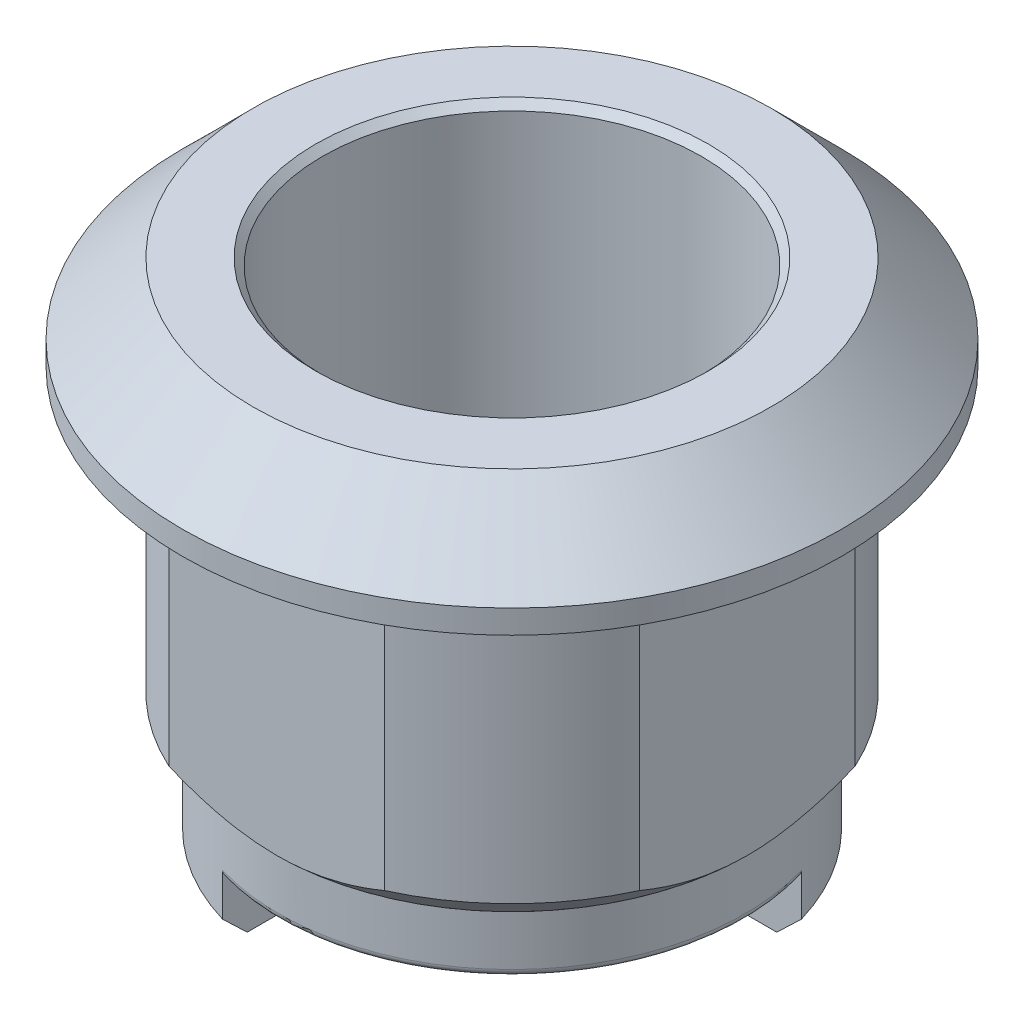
ISO-10303-21;
HEADER;
FILE_DESCRIPTION(('STEP AP214'),'2;1');
FILE_NAME('part.step','',(''),(''),'','','');
FILE_SCHEMA(('AUTOMOTIVE_DESIGN { 1 0 10303 214 1 1 1 1 }'));
ENDSEC;
DATA;
#1=APPLICATION_CONTEXT('core data for automotive mechanical design processes');
#2=APPLICATION_PROTOCOL_DEFINITION('international standard','automotive_design',2000,#1);
#3=PRODUCT_CONTEXT('',#1,'mechanical');
#4=PRODUCT('Part','Part','',(#3));
#5=PRODUCT_RELATED_PRODUCT_CATEGORY('part','',(#4));
#6=PRODUCT_DEFINITION_FORMATION('','',#4);
#7=PRODUCT_DEFINITION_CONTEXT('part definition',#1,'design');
#8=PRODUCT_DEFINITION('design','',#6,#7);
#9=PRODUCT_DEFINITION_SHAPE('','',#8);
#10=(LENGTH_UNIT() NAMED_UNIT(*) SI_UNIT(.MILLI.,.METRE.));
#11=(NAMED_UNIT(*) PLANE_ANGLE_UNIT() SI_UNIT($,.RADIAN.));
#12=(NAMED_UNIT(*) SI_UNIT($,.STERADIAN.) SOLID_ANGLE_UNIT());
#13=UNCERTAINTY_MEASURE_WITH_UNIT(LENGTH_MEASURE(1.E-05),#10,'distance_accuracy_value','');
#14=(GEOMETRIC_REPRESENTATION_CONTEXT(3) GLOBAL_UNCERTAINTY_ASSIGNED_CONTEXT((#13)) GLOBAL_UNIT_ASSIGNED_CONTEXT((#10,
#11,#12)) REPRESENTATION_CONTEXT('',''));
#15=CARTESIAN_POINT('',(0.,0.,0.));
#16=DIRECTION('',(0.,0.,1.));
#17=DIRECTION('',(1.,0.,0.));
#18=AXIS2_PLACEMENT_3D('',#15,#16,#17);
#19=CARTESIAN_POINT('',(0.,-11.9999999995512,0.));
#20=DIRECTION('',(0.,1.,0.));
#21=DIRECTION('',(0.,0.,1.));
#22=AXIS2_PLACEMENT_3D('',#19,#20,#21);
#23=CONICAL_SURFACE('',#22,10.9999999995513,0.785398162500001);
#24=CARTESIAN_POINT('',(0.,-13.0000000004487,0.));
#25=DIRECTION('',(0.,1.,0.));
#26=DIRECTION('',(0.,0.,1.));
#27=AXIS2_PLACEMENT_3D('',#24,#25,#26);
#28=CIRCLE('',#27,10.0000000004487);
#29=CARTESIAN_POINT('',(-2.71595792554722E-11,-13.0000000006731,-10.0000000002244));
#30=VERTEX_POINT('',#29);
#31=CARTESIAN_POINT('',(10.0000000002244,-13.0000000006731,2.71609482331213E-11));
#32=VERTEX_POINT('',#31);
#33=EDGE_CURVE('P0_E409',#30,#32,#28,.F.);
#34=ORIENTED_EDGE('',*,*,#33,.F.);
#35=CARTESIAN_POINT('',(-2.71598870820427E-11,-13.0000000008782,-9.99999999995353));
#36=CARTESIAN_POINT('',(0.153419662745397,-13.0000177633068,-9.99999999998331));
#37=CARTESIAN_POINT('',(0.306833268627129,-12.996469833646,-9.99999999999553));
#38=CARTESIAN_POINT('',(0.613315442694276,-12.9823745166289,-10.0000000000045));
#39=CARTESIAN_POINT('',(0.766384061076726,-12.9718282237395,-10.0000000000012));
#40=CARTESIAN_POINT('',(1.07166096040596,-12.9438891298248,-9.9999999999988));
#41=CARTESIAN_POINT('',(1.22387019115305,-12.9265066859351,-9.99999999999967));
#42=CARTESIAN_POINT('',(1.52738320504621,-12.8851453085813,-10.0000000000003));
#43=CARTESIAN_POINT('',(1.67868696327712,-12.8611661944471,-10.0000000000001));
#44=CARTESIAN_POINT('',(2.12685071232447,-12.7805087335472,-9.99999999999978));
#45=CARTESIAN_POINT('',(2.42210425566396,-12.7147147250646,-9.99999999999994));
#46=CARTESIAN_POINT('',(3.00688490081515,-12.561532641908,-10.0000000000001));
#47=CARTESIAN_POINT('',(3.2964114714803,-12.474142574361,-10.));
#48=CARTESIAN_POINT('',(3.75125759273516,-12.3207320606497,-9.99999999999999));
#49=CARTESIAN_POINT('',(3.91864293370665,-12.2607244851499,-10.));
#50=CARTESIAN_POINT('',(4.25191341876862,-12.1346928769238,-10.));
#51=CARTESIAN_POINT('',(4.41778971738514,-12.0686454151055,-10.));
#52=CARTESIAN_POINT('',(4.58257569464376,-11.9999999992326,-10.));
#53=B_SPLINE_CURVE_WITH_KNOTS('',3,(#35,#36,#37,#38,#39,#40,#41,#42,#43,#44,#45,#46,#47,#48,#49,
#50,#51,#52),.UNSPECIFIED.,.F.,.F.,(4,2,2,2,2,2,2,2,4),(0.,0.460207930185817,0.920343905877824,
1.37978541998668,1.83923951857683,2.74570852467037,3.65226121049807,4.18561484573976,
4.72113306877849),.UNSPECIFIED.);
#54=CARTESIAN_POINT('',(4.58257569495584,-11.9999999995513,-10.));
#55=VERTEX_POINT('',#54);
#56=EDGE_CURVE('P0_E180',#30,#55,#53,.T.);
#57=ORIENTED_EDGE('',*,*,#56,.T.);
#58=CARTESIAN_POINT('',(0.,-12.,0.));
#59=DIRECTION('',(0.,-1.,0.));
#60=DIRECTION('',(0.,0.,-1.));
#61=AXIS2_PLACEMENT_3D('',#58,#59,#60);
#62=CIRCLE('',#61,11.);
#63=CARTESIAN_POINT('',(10.,-11.9999999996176,-4.58257569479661));
#64=VERTEX_POINT('',#63);
#65=EDGE_CURVE('P0_E220',#64,#55,#62,.F.);
#66=ORIENTED_EDGE('',*,*,#65,.F.);
#67=CARTESIAN_POINT('',(10.000000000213,-11.9999999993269,-4.58257569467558));
#68=CARTESIAN_POINT('',(10.0000000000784,-12.075929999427,-4.40028329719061));
#69=CARTESIAN_POINT('',(10.0000000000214,-12.1486818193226,-4.21668434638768));
#70=CARTESIAN_POINT('',(9.99999999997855,-12.2870431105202,-3.84668711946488));
#71=CARTESIAN_POINT('',(9.99999999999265,-12.3526480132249,-3.66028713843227));
#72=CARTESIAN_POINT('',(10.0000000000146,-12.5361412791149,-3.10086162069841));
#73=CARTESIAN_POINT('',(10.0000000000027,-12.6423213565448,-2.723819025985));
#74=CARTESIAN_POINT('',(9.99999999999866,-12.7728762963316,-2.15145029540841));
#75=CARTESIAN_POINT('',(9.99999999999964,-12.8116334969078,-1.95932775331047));
#76=CARTESIAN_POINT('',(10.0000000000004,-12.8787828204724,-1.57326186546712));
#77=CARTESIAN_POINT('',(10.0000000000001,-12.9071754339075,-1.37931860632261));
#78=CARTESIAN_POINT('',(9.9999999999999,-12.9531827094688,-0.988206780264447));
#79=CARTESIAN_POINT('',(9.99999999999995,-12.970688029,-0.791025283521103));
#80=CARTESIAN_POINT('',(10.0000000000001,-12.99412298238,-0.395902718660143));
#81=CARTESIAN_POINT('',(10.0000000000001,-13.0000481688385,-0.19796138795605));
#82=CARTESIAN_POINT('',(10.,-13.0000000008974,1.91428998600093E-11));
#83=B_SPLINE_CURVE_WITH_KNOTS('',3,(#67,#68,#69,#70,#71,#72,#73,#74,#75,#76,#77,#78,#79,#80,#81,
#82),.UNSPECIFIED.,.F.,.F.,(4,2,2,2,2,2,2,4),(0.,0.592342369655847,1.18506119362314,
2.35817128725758,2.94592281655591,3.53364653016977,4.12718135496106,4.72094408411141),.UNSPECIFIED.);
#84=EDGE_CURVE('P0_E208',#64,#32,#83,.T.);
#85=ORIENTED_EDGE('',*,*,#84,.T.);
#86=EDGE_LOOP('',(#34,#57,#66,#85));
#87=FACE_BOUND('',#86,.T.);
#88=ADVANCED_FACE('P0_F16',(#87),#23,.T.);
#89=CARTESIAN_POINT('',(0.,-11.9999999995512,0.));
#90=DIRECTION('',(0.,1.,0.));
#91=DIRECTION('',(0.,0.,1.));
#92=AXIS2_PLACEMENT_3D('',#89,#90,#91);
#93=CONICAL_SURFACE('',#92,10.9999999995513,0.785398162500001);
#94=CARTESIAN_POINT('',(0.,-12.,0.));
#95=DIRECTION('',(0.,-1.,0.));
#96=DIRECTION('',(0.,0.,-1.));
#97=AXIS2_PLACEMENT_3D('',#94,#95,#96);
#98=CIRCLE('',#97,11.);
#99=CARTESIAN_POINT('',(4.58257569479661,-11.9999999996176,10.));
#100=VERTEX_POINT('',#99);
#101=CARTESIAN_POINT('',(10.,-11.9999999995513,4.58257569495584));
#102=VERTEX_POINT('',#101);
#103=EDGE_CURVE('P0_E426',#100,#102,#98,.F.);
#104=ORIENTED_EDGE('',*,*,#103,.F.);
#105=CARTESIAN_POINT('',(4.58257569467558,-11.9999999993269,10.000000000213));
#106=CARTESIAN_POINT('',(4.40028329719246,-12.0759299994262,10.0000000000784));
#107=CARTESIAN_POINT('',(4.21668434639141,-12.1486818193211,10.0000000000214));
#108=CARTESIAN_POINT('',(3.84668711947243,-12.2870431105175,9.99999999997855));
#109=CARTESIAN_POINT('',(3.66028713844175,-12.3526480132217,9.99999999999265));
#110=CARTESIAN_POINT('',(3.10086162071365,-12.5361412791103,10.0000000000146));
#111=CARTESIAN_POINT('',(2.72381902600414,-12.6423213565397,10.0000000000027));
#112=CARTESIAN_POINT('',(2.1514502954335,-12.7728762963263,9.99999999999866));
#113=CARTESIAN_POINT('',(1.95932775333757,-12.8116334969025,9.99999999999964));
#114=CARTESIAN_POINT('',(1.57326186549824,-12.8787828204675,10.0000000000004));
#115=CARTESIAN_POINT('',(1.37931860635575,-12.9071754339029,10.0000000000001));
#116=CARTESIAN_POINT('',(0.988206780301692,-12.9531827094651,9.9999999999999));
#117=CARTESIAN_POINT('',(0.791025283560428,-12.9706880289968,9.99999999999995));
#118=CARTESIAN_POINT('',(0.3959027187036,-12.9941229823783,10.0000000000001));
#119=CARTESIAN_POINT('',(0.197961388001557,-13.0000481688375,10.0000000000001));
#120=CARTESIAN_POINT('',(2.83866783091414E-11,-13.0000000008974,10.));
#121=B_SPLINE_CURVE_WITH_KNOTS('',3,(#105,#106,#107,#108,#109,#110,#111,#112,#113,#114,#115,
#116,#117,#118,#119,#120),.UNSPECIFIED.,.F.,.F.,(4,2,2,2,2,2,2,4),(0.,0.592342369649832,
1.1850611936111,2.35817128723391,2.94592281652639,3.5336465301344,4.12718135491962,
4.72094408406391),.UNSPECIFIED.);
#122=CARTESIAN_POINT('',(2.37637563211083E-11,-13.0000000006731,10.0000000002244));
#123=VERTEX_POINT('',#122);
#124=EDGE_CURVE('P0_E228',#100,#123,#121,.T.);
#125=ORIENTED_EDGE('',*,*,#124,.T.);
#126=CARTESIAN_POINT('',(0.,-13.0000000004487,0.));
#127=DIRECTION('',(0.,1.,0.));
#128=DIRECTION('',(0.,0.,1.));
#129=AXIS2_PLACEMENT_3D('',#126,#127,#128);
#130=CIRCLE('',#129,10.0000000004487);
#131=EDGE_CURVE('P0_E407',#32,#123,#130,.F.);
#132=ORIENTED_EDGE('',*,*,#131,.F.);
#133=CARTESIAN_POINT('',(9.99999999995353,-13.0000000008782,2.71607880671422E-11));
#134=CARTESIAN_POINT('',(9.99999999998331,-13.000017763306,0.153419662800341));
#135=CARTESIAN_POINT('',(9.99999999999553,-12.9964698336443,0.306833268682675));
#136=CARTESIAN_POINT('',(10.0000000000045,-12.9823745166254,0.613315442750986));
#137=CARTESIAN_POINT('',(10.0000000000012,-12.9718282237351,0.766384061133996));
#138=CARTESIAN_POINT('',(9.9999999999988,-12.9438891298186,1.0716609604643));
#139=CARTESIAN_POINT('',(9.99999999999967,-12.9265066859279,1.22387019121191));
#140=CARTESIAN_POINT('',(10.0000000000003,-12.8851453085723,1.52738320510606));
#141=CARTESIAN_POINT('',(10.0000000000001,-12.8611661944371,1.67868696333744));
#142=CARTESIAN_POINT('',(9.99999999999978,-12.7805087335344,2.12685071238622));
#143=CARTESIAN_POINT('',(9.99999999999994,-12.7147147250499,2.4221042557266));
#144=CARTESIAN_POINT('',(10.0000000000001,-12.5615326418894,3.00688490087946));
#145=CARTESIAN_POINT('',(10.,-12.4741425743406,3.2964114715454));
#146=CARTESIAN_POINT('',(9.99999999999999,-12.3207320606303,3.7512575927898));
#147=CARTESIAN_POINT('',(10.,-12.2607244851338,3.91864293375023));
#148=CARTESIAN_POINT('',(10.,-12.1346928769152,4.25191341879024));
#149=CARTESIAN_POINT('',(10.,-12.0686454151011,4.41778971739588));
#150=CARTESIAN_POINT('',(10.,-11.9999999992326,4.58257569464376));
#151=B_SPLINE_CURVE_WITH_KNOTS('',3,(#133,#134,#135,#136,#137,#138,#139,#140,#141,#142,#143,
#144,#145,#146,#147,#148,#149,#150),.UNSPECIFIED.,.F.,.F.,(4,2,2,2,2,2,2,2,4),(0.,
0.460207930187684,0.920343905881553,1.37978541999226,1.83923951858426,2.74570852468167,
3.65226121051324,4.18561484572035,4.72113306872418),.UNSPECIFIED.);
#152=EDGE_CURVE('P0_E214',#32,#102,#151,.T.);
#153=ORIENTED_EDGE('',*,*,#152,.T.);
#154=EDGE_LOOP('',(#104,#125,#132,#153));
#155=FACE_BOUND('',#154,.T.);
#156=ADVANCED_FACE('P0_F222',(#155),#93,.T.);
#157=CARTESIAN_POINT('',(0.,-11.9999999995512,0.));
#158=DIRECTION('',(0.,1.,0.));
#159=DIRECTION('',(0.,0.,1.));
#160=AXIS2_PLACEMENT_3D('',#157,#158,#159);
#161=CONICAL_SURFACE('',#160,10.9999999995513,0.7853981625);
#162=CARTESIAN_POINT('',(0.,-13.0000000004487,0.));
#163=DIRECTION('',(0.,1.,0.));
#164=DIRECTION('',(0.,0.,1.));
#165=AXIS2_PLACEMENT_3D('',#162,#163,#164);
#166=CIRCLE('',#165,10.0000000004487);
#167=CARTESIAN_POINT('',(-10.0000000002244,-13.0000000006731,-2.71619724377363E-11));
#168=VERTEX_POINT('',#167);
#169=EDGE_CURVE('P0_E405',#123,#168,#166,.F.);
#170=ORIENTED_EDGE('',*,*,#169,.F.);
#171=CARTESIAN_POINT('',(2.03695216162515E-11,-13.0000000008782,9.99999999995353));
#172=CARTESIAN_POINT('',(-0.153419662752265,-13.0000177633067,9.99999999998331));
#173=CARTESIAN_POINT('',(-0.306833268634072,-12.9964698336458,9.99999999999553));
#174=CARTESIAN_POINT('',(-0.613315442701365,-12.9823745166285,10.0000000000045));
#175=CARTESIAN_POINT('',(-0.766384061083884,-12.971828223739,10.0000000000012));
#176=CARTESIAN_POINT('',(-1.07166096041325,-12.9438891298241,9.9999999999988));
#177=CARTESIAN_POINT('',(-1.22387019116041,-12.9265066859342,9.99999999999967));
#178=CARTESIAN_POINT('',(-1.52738320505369,-12.8851453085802,10.0000000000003));
#179=CARTESIAN_POINT('',(-1.67868696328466,-12.8611661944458,10.0000000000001));
#180=CARTESIAN_POINT('',(-2.12685071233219,-12.7805087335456,9.99999999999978));
#181=CARTESIAN_POINT('',(-2.42210425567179,-12.7147147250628,9.99999999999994));
#182=CARTESIAN_POINT('',(-3.00688490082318,-12.5615326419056,10.0000000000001));
#183=CARTESIAN_POINT('',(-3.29641147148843,-12.4741425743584,10.));
#184=CARTESIAN_POINT('',(-3.75125759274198,-12.3207320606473,9.99999999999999));
#185=CARTESIAN_POINT('',(-3.9186429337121,-12.2607244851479,10.));
#186=CARTESIAN_POINT('',(-4.25191341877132,-12.1346928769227,10.));
#187=CARTESIAN_POINT('',(-4.41778971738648,-12.068645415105,10.));
#188=CARTESIAN_POINT('',(-4.58257569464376,-11.9999999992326,10.));
#189=B_SPLINE_CURVE_WITH_KNOTS('',3,(#171,#172,#173,#174,#175,#176,#177,#178,#179,#180,#181,
#182,#183,#184,#185,#186,#187,#188),.UNSPECIFIED.,.F.,.F.,(4,2,2,2,2,2,2,2,4),(0.,
0.46020793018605,0.920343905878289,1.37978541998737,1.83923951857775,2.74570852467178,
3.65226121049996,4.18561484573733,4.7211330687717),.UNSPECIFIED.);
#190=CARTESIAN_POINT('',(-4.58257569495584,-11.9999999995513,10.));
#191=VERTEX_POINT('',#190);
#192=EDGE_CURVE('P0_E234',#123,#191,#189,.T.);
#193=ORIENTED_EDGE('',*,*,#192,.T.);
#194=CARTESIAN_POINT('',(0.,-12.,0.));
#195=DIRECTION('',(0.,-1.,0.));
#196=DIRECTION('',(0.,0.,-1.));
#197=AXIS2_PLACEMENT_3D('',#194,#195,#196);
#198=CIRCLE('',#197,11.);
#199=CARTESIAN_POINT('',(-10.,-11.9999999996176,4.58257569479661));
#200=VERTEX_POINT('',#199);
#201=EDGE_CURVE('P0_E148',#200,#191,#198,.F.);
#202=ORIENTED_EDGE('',*,*,#201,.F.);
#203=CARTESIAN_POINT('',(-10.000000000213,-11.9999999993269,4.58257569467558));
#204=CARTESIAN_POINT('',(-10.0000000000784,-12.075929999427,4.4002832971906));
#205=CARTESIAN_POINT('',(-10.0000000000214,-12.1486818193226,4.21668434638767));
#206=CARTESIAN_POINT('',(-9.99999999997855,-12.2870431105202,3.84668711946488));
#207=CARTESIAN_POINT('',(-9.99999999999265,-12.3526480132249,3.66028713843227));
#208=CARTESIAN_POINT('',(-10.0000000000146,-12.5361412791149,3.10086162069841));
#209=CARTESIAN_POINT('',(-10.0000000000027,-12.6423213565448,2.723819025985));
#210=CARTESIAN_POINT('',(-9.99999999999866,-12.7728762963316,2.15145029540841));
#211=CARTESIAN_POINT('',(-9.99999999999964,-12.8116334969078,1.95932775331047));
#212=CARTESIAN_POINT('',(-10.0000000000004,-12.8787828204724,1.57326186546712));
#213=CARTESIAN_POINT('',(-10.0000000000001,-12.9071754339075,1.37931860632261));
#214=CARTESIAN_POINT('',(-9.9999999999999,-12.9531827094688,0.988206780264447));
#215=CARTESIAN_POINT('',(-9.99999999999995,-12.970688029,0.791025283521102));
#216=CARTESIAN_POINT('',(-10.0000000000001,-12.99412298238,0.395902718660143));
#217=CARTESIAN_POINT('',(-10.0000000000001,-13.0000481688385,0.197961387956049));
#218=CARTESIAN_POINT('',(-10.,-13.0000000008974,-1.91430190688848E-11));
#219=B_SPLINE_CURVE_WITH_KNOTS('',3,(#203,#204,#205,#206,#207,#208,#209,#210,#211,#212,#213,
#214,#215,#216,#217,#218),.UNSPECIFIED.,.F.,.F.,(4,2,2,2,2,2,2,4),(0.,0.592342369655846,
1.18506119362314,2.35817128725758,2.94592281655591,3.53364653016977,4.12718135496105,
4.72094408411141),.UNSPECIFIED.);
#220=EDGE_CURVE('P0_E143',#200,#168,#219,.T.);
#221=ORIENTED_EDGE('',*,*,#220,.T.);
#222=EDGE_LOOP('',(#170,#193,#202,#221));
#223=FACE_BOUND('',#222,.T.);
#224=ADVANCED_FACE('P0_F169',(#223),#161,.T.);
#225=CARTESIAN_POINT('',(0.,-11.9999999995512,0.));
#226=DIRECTION('',(0.,1.,0.));
#227=DIRECTION('',(0.,0.,1.));
#228=AXIS2_PLACEMENT_3D('',#225,#226,#227);
#229=CONICAL_SURFACE('',#228,10.9999999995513,0.7853981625);
#230=CARTESIAN_POINT('',(0.,-12.,0.));
#231=DIRECTION('',(0.,-1.,0.));
#232=DIRECTION('',(0.,0.,-1.));
#233=AXIS2_PLACEMENT_3D('',#230,#231,#232);
#234=CIRCLE('',#233,11.);
#235=CARTESIAN_POINT('',(-4.58257569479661,-11.9999999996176,-10.));
#236=VERTEX_POINT('',#235);
#237=CARTESIAN_POINT('',(-10.,-11.9999999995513,-4.58257569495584));
#238=VERTEX_POINT('',#237);
#239=EDGE_CURVE('P0_E126',#236,#238,#234,.F.);
#240=ORIENTED_EDGE('',*,*,#239,.F.);
#241=CARTESIAN_POINT('',(-4.58257569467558,-11.9999999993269,-10.000000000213));
#242=CARTESIAN_POINT('',(-4.40028329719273,-12.0759299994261,-10.0000000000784));
#243=CARTESIAN_POINT('',(-4.21668434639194,-12.1486818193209,-10.0000000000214));
#244=CARTESIAN_POINT('',(-3.84668711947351,-12.2870431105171,-9.99999999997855));
#245=CARTESIAN_POINT('',(-3.66028713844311,-12.3526480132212,-9.99999999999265));
#246=CARTESIAN_POINT('',(-3.10086162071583,-12.5361412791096,-10.0000000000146));
#247=CARTESIAN_POINT('',(-2.72381902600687,-12.6423213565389,-10.0000000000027));
#248=CARTESIAN_POINT('',(-2.15145029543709,-12.7728762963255,-9.99999999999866));
#249=CARTESIAN_POINT('',(-1.95932775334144,-12.8116334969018,-9.99999999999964));
#250=CARTESIAN_POINT('',(-1.57326186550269,-12.8787828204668,-10.0000000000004));
#251=CARTESIAN_POINT('',(-1.37931860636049,-12.9071754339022,-10.0000000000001));
#252=CARTESIAN_POINT('',(-0.988206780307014,-12.9531827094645,-9.9999999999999));
#253=CARTESIAN_POINT('',(-0.791025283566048,-12.9706880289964,-9.99999999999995));
#254=CARTESIAN_POINT('',(-0.39590271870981,-12.994122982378,-10.0000000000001));
#255=CARTESIAN_POINT('',(-0.19796138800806,-13.0000481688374,-10.0000000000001));
#256=CARTESIAN_POINT('',(-3.51786457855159E-11,-13.0000000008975,-10.));
#257=B_SPLINE_CURVE_WITH_KNOTS('',3,(#241,#242,#243,#244,#245,#246,#247,#248,#249,#250,#251,
#252,#253,#254,#255,#256),.UNSPECIFIED.,.F.,.F.,(4,2,2,2,2,2,2,4),(0.,0.592342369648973,
1.18506119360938,2.35817128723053,2.94592281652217,3.53364653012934,4.1271813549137,
4.72094408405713),.UNSPECIFIED.);
#258=EDGE_CURVE('P0_E173',#236,#30,#257,.T.);
#259=ORIENTED_EDGE('',*,*,#258,.T.);
#260=CARTESIAN_POINT('',(0.,-13.0000000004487,0.));
#261=DIRECTION('',(0.,1.,0.));
#262=DIRECTION('',(0.,0.,1.));
#263=AXIS2_PLACEMENT_3D('',#260,#261,#262);
#264=CIRCLE('',#263,10.0000000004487);
#265=EDGE_CURVE('P0_E146',#168,#30,#264,.F.);
#266=ORIENTED_EDGE('',*,*,#265,.F.);
#267=CARTESIAN_POINT('',(-9.99999999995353,-13.0000000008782,-2.71616118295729E-11));
#268=CARTESIAN_POINT('',(-9.99999999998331,-13.000017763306,-0.153419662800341));
#269=CARTESIAN_POINT('',(-9.99999999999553,-12.9964698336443,-0.306833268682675));
#270=CARTESIAN_POINT('',(-10.0000000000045,-12.9823745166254,-0.613315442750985));
#271=CARTESIAN_POINT('',(-10.0000000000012,-12.9718282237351,-0.766384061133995));
#272=CARTESIAN_POINT('',(-9.9999999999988,-12.9438891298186,-1.0716609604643));
#273=CARTESIAN_POINT('',(-9.99999999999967,-12.9265066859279,-1.22387019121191));
#274=CARTESIAN_POINT('',(-10.0000000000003,-12.8851453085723,-1.52738320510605));
#275=CARTESIAN_POINT('',(-10.0000000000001,-12.8611661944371,-1.67868696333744));
#276=CARTESIAN_POINT('',(-9.99999999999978,-12.7805087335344,-2.12685071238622));
#277=CARTESIAN_POINT('',(-9.99999999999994,-12.7147147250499,-2.4221042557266));
#278=CARTESIAN_POINT('',(-10.0000000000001,-12.5615326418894,-3.00688490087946));
#279=CARTESIAN_POINT('',(-10.,-12.4741425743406,-3.2964114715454));
#280=CARTESIAN_POINT('',(-9.99999999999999,-12.3207320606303,-3.7512575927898));
#281=CARTESIAN_POINT('',(-10.,-12.2607244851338,-3.91864293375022));
#282=CARTESIAN_POINT('',(-10.,-12.1346928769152,-4.25191341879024));
#283=CARTESIAN_POINT('',(-10.,-12.0686454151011,-4.41778971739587));
#284=CARTESIAN_POINT('',(-10.,-11.9999999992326,-4.58257569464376));
#285=B_SPLINE_CURVE_WITH_KNOTS('',3,(#267,#268,#269,#270,#271,#272,#273,#274,#275,#276,#277,
#278,#279,#280,#281,#282,#283,#284),.UNSPECIFIED.,.F.,.F.,(4,2,2,2,2,2,2,2,4),(0.,
0.460207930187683,0.920343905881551,1.37978541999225,1.83923951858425,2.74570852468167,
3.65226121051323,4.18561484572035,4.72113306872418),.UNSPECIFIED.);
#286=EDGE_CURVE('P0_E139',#168,#238,#285,.T.);
#287=ORIENTED_EDGE('',*,*,#286,.T.);
#288=EDGE_LOOP('',(#240,#259,#266,#287));
#289=FACE_BOUND('',#288,.T.);
#290=ADVANCED_FACE('P0_F144',(#289),#229,.T.);
#291=CARTESIAN_POINT('',(0.,5.1,0.));
#292=DIRECTION('',(0.,-1.,0.));
#293=DIRECTION('',(0.,0.,-1.));
#294=AXIS2_PLACEMENT_3D('',#291,#292,#293);
#295=CYLINDRICAL_SURFACE('',#294,11.);
#296=CARTESIAN_POINT('',(0.,0.,0.));
#297=DIRECTION('',(0.,-1.,0.));
#298=DIRECTION('',(0.,0.,-1.));
#299=AXIS2_PLACEMENT_3D('',#296,#297,#298);
#300=CIRCLE('',#299,11.);
#301=CARTESIAN_POINT('',(-4.58257569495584,0.,-10.));
#302=VERTEX_POINT('',#301);
#303=CARTESIAN_POINT('',(-10.,0.,-4.58257569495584));
#304=VERTEX_POINT('',#303);
#305=EDGE_CURVE('P0_E401',#302,#304,#300,.F.);
#306=ORIENTED_EDGE('',*,*,#305,.F.);
#307=DIRECTION('',(0.,-1.,0.));
#308=VECTOR('',#307,1.);
#309=CARTESIAN_POINT('',(-4.58257569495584,0.,-10.));
#310=LINE('',#309,#308);
#311=EDGE_CURVE('P0_E131',#302,#236,#310,.T.);
#312=ORIENTED_EDGE('',*,*,#311,.T.);
#313=ORIENTED_EDGE('',*,*,#239,.T.);
#314=DIRECTION('',(0.,-1.,0.));
#315=VECTOR('',#314,1.);
#316=CARTESIAN_POINT('',(-10.,-11.9999999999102,-4.58257569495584));
#317=LINE('',#316,#315);
#318=EDGE_CURVE('P0_E20',#238,#304,#317,.F.);
#319=ORIENTED_EDGE('',*,*,#318,.T.);
#320=EDGE_LOOP('',(#306,#312,#313,#319));
#321=FACE_BOUND('',#320,.T.);
#322=ADVANCED_FACE('P0_F129',(#321),#295,.T.);
#323=CARTESIAN_POINT('',(-10.,0.,10.));
#324=DIRECTION('',(1.,0.,0.));
#325=DIRECTION('',(0.,0.,-1.));
#326=AXIS2_PLACEMENT_3D('',#323,#324,#325);
#327=PLANE('',#326);
#328=ORIENTED_EDGE('',*,*,#220,.F.);
#329=DIRECTION('',(0.,-1.,0.));
#330=VECTOR('',#329,1.);
#331=CARTESIAN_POINT('',(-10.,0.,4.58257569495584));
#332=LINE('',#331,#330);
#333=CARTESIAN_POINT('',(-10.,0.,4.58257275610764));
#334=VERTEX_POINT('',#333);
#335=EDGE_CURVE('P0_E150',#334,#200,#332,.T.);
#336=ORIENTED_EDGE('',*,*,#335,.F.);
#337=DIRECTION('',(0.,0.,1.));
#338=VECTOR('',#337,1.);
#339=CARTESIAN_POINT('',(-10.,0.,0.));
#340=LINE('',#339,#338);
#341=EDGE_CURVE('P0_E142',#304,#334,#340,.T.);
#342=ORIENTED_EDGE('',*,*,#341,.F.);
#343=ORIENTED_EDGE('',*,*,#318,.F.);
#344=ORIENTED_EDGE('',*,*,#286,.F.);
#345=EDGE_LOOP('',(#328,#336,#342,#343,#344));
#346=FACE_BOUND('',#345,.T.);
#347=ADVANCED_FACE('P0_F138',(#346),#327,.F.);
#348=CARTESIAN_POINT('',(0.,5.1,0.));
#349=DIRECTION('',(0.,-1.,0.));
#350=DIRECTION('',(0.,0.,-1.));
#351=AXIS2_PLACEMENT_3D('',#348,#349,#350);
#352=CYLINDRICAL_SURFACE('',#351,11.);
#353=CARTESIAN_POINT('',(0.,0.,0.));
#354=DIRECTION('',(0.,-1.,0.));
#355=DIRECTION('',(0.,0.,-1.));
#356=AXIS2_PLACEMENT_3D('',#353,#354,#355);
#357=CIRCLE('',#356,11.);
#358=CARTESIAN_POINT('',(-4.58257569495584,0.,10.));
#359=VERTEX_POINT('',#358);
#360=EDGE_CURVE('P0_E398',#334,#359,#357,.F.);
#361=ORIENTED_EDGE('',*,*,#360,.F.);
#362=ORIENTED_EDGE('',*,*,#335,.T.);
#363=ORIENTED_EDGE('',*,*,#201,.T.);
#364=DIRECTION('',(0.,-1.,0.));
#365=VECTOR('',#364,1.);
#366=CARTESIAN_POINT('',(-4.58257569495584,-11.9999999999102,10.));
#367=LINE('',#366,#365);
#368=EDGE_CURVE('P0_E235',#191,#359,#367,.F.);
#369=ORIENTED_EDGE('',*,*,#368,.T.);
#370=EDGE_LOOP('',(#361,#362,#363,#369));
#371=FACE_BOUND('',#370,.T.);
#372=ADVANCED_FACE('P0_F243',(#371),#352,.T.);
#373=CARTESIAN_POINT('',(10.,0.,10.));
#374=DIRECTION('',(0.,0.,-1.));
#375=DIRECTION('',(-1.,0.,0.));
#376=AXIS2_PLACEMENT_3D('',#373,#374,#375);
#377=PLANE('',#376);
#378=ORIENTED_EDGE('',*,*,#124,.F.);
#379=DIRECTION('',(0.,-1.,0.));
#380=VECTOR('',#379,1.);
#381=CARTESIAN_POINT('',(4.58257569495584,0.,10.));
#382=LINE('',#381,#380);
#383=CARTESIAN_POINT('',(4.58257569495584,0.,10.));
#384=VERTEX_POINT('',#383);
#385=EDGE_CURVE('P0_E427',#384,#100,#382,.T.);
#386=ORIENTED_EDGE('',*,*,#385,.F.);
#387=DIRECTION('',(1.,0.,0.));
#388=VECTOR('',#387,1.);
#389=CARTESIAN_POINT('',(0.,0.,10.));
#390=LINE('',#389,#388);
#391=EDGE_CURVE('P0_E396',#359,#384,#390,.T.);
#392=ORIENTED_EDGE('',*,*,#391,.F.);
#393=ORIENTED_EDGE('',*,*,#368,.F.);
#394=ORIENTED_EDGE('',*,*,#192,.F.);
#395=EDGE_LOOP('',(#378,#386,#392,#393,#394));
#396=FACE_BOUND('',#395,.T.);
#397=ADVANCED_FACE('P0_F240',(#396),#377,.F.);
#398=CARTESIAN_POINT('',(0.,5.1,0.));
#399=DIRECTION('',(0.,-1.,0.));
#400=DIRECTION('',(0.,0.,-1.));
#401=AXIS2_PLACEMENT_3D('',#398,#399,#400);
#402=CYLINDRICAL_SURFACE('',#401,11.);
#403=CARTESIAN_POINT('',(0.,0.,0.));
#404=DIRECTION('',(0.,-1.,0.));
#405=DIRECTION('',(0.,0.,-1.));
#406=AXIS2_PLACEMENT_3D('',#403,#404,#405);
#407=CIRCLE('',#406,11.);
#408=CARTESIAN_POINT('',(10.000001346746,0.,4.58257275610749));
#409=VERTEX_POINT('',#408);
#410=EDGE_CURVE('P0_E394',#384,#409,#407,.F.);
#411=ORIENTED_EDGE('',*,*,#410,.F.);
#412=ORIENTED_EDGE('',*,*,#385,.T.);
#413=ORIENTED_EDGE('',*,*,#103,.T.);
#414=DIRECTION('',(0.,-1.,0.));
#415=VECTOR('',#414,1.);
#416=CARTESIAN_POINT('',(10.,-11.9999999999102,4.58257569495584));
#417=LINE('',#416,#415);
#418=EDGE_CURVE('P0_E485',#102,#409,#417,.F.);
#419=ORIENTED_EDGE('',*,*,#418,.T.);
#420=EDGE_LOOP('',(#411,#412,#413,#419));
#421=FACE_BOUND('',#420,.T.);
#422=ADVANCED_FACE('P0_F203',(#421),#402,.T.);
#423=CARTESIAN_POINT('',(10.,0.,-10.));
#424=DIRECTION('',(-1.,0.,0.));
#425=DIRECTION('',(0.,0.,1.));
#426=AXIS2_PLACEMENT_3D('',#423,#424,#425);
#427=PLANE('',#426);
#428=ORIENTED_EDGE('',*,*,#84,.F.);
#429=DIRECTION('',(0.,-1.,0.));
#430=VECTOR('',#429,1.);
#431=CARTESIAN_POINT('',(10.,0.,-4.58257569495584));
#432=LINE('',#431,#430);
#433=CARTESIAN_POINT('',(10.,0.,-4.58257569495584));
#434=VERTEX_POINT('',#433);
#435=EDGE_CURVE('P0_E221',#434,#64,#432,.T.);
#436=ORIENTED_EDGE('',*,*,#435,.F.);
#437=DIRECTION('',(0.,0.,-1.));
#438=VECTOR('',#437,1.);
#439=CARTESIAN_POINT('',(10.,0.,0.));
#440=LINE('',#439,#438);
#441=EDGE_CURVE('P0_E392',#409,#434,#440,.T.);
#442=ORIENTED_EDGE('',*,*,#441,.F.);
#443=ORIENTED_EDGE('',*,*,#418,.F.);
#444=ORIENTED_EDGE('',*,*,#152,.F.);
#445=EDGE_LOOP('',(#428,#436,#442,#443,#444));
#446=FACE_BOUND('',#445,.T.);
#447=ADVANCED_FACE('P0_F198',(#446),#427,.F.);
#448=CARTESIAN_POINT('',(0.,5.1,0.));
#449=DIRECTION('',(0.,-1.,0.));
#450=DIRECTION('',(0.,0.,-1.));
#451=AXIS2_PLACEMENT_3D('',#448,#449,#450);
#452=CYLINDRICAL_SURFACE('',#451,11.);
#453=CARTESIAN_POINT('',(0.,0.,0.));
#454=DIRECTION('',(0.,-1.,0.));
#455=DIRECTION('',(0.,0.,-1.));
#456=AXIS2_PLACEMENT_3D('',#453,#454,#455);
#457=CIRCLE('',#456,11.);
#458=CARTESIAN_POINT('',(4.58257569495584,0.,-10.));
#459=VERTEX_POINT('',#458);
#460=EDGE_CURVE('P0_E390',#434,#459,#457,.F.);
#461=ORIENTED_EDGE('',*,*,#460,.F.);
#462=ORIENTED_EDGE('',*,*,#435,.T.);
#463=ORIENTED_EDGE('',*,*,#65,.T.);
#464=DIRECTION('',(0.,-1.,0.));
#465=VECTOR('',#464,1.);
#466=CARTESIAN_POINT('',(4.58257569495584,-11.9999999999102,-10.));
#467=LINE('',#466,#465);
#468=EDGE_CURVE('P0_E420',#55,#459,#467,.F.);
#469=ORIENTED_EDGE('',*,*,#468,.T.);
#470=EDGE_LOOP('',(#461,#462,#463,#469));
#471=FACE_BOUND('',#470,.T.);
#472=ADVANCED_FACE('P0_F192',(#471),#452,.T.);
#473=CARTESIAN_POINT('',(-10.,0.,-10.));
#474=DIRECTION('',(0.,0.,1.));
#475=DIRECTION('',(1.,0.,0.));
#476=AXIS2_PLACEMENT_3D('',#473,#474,#475);
#477=PLANE('',#476);
#478=ORIENTED_EDGE('',*,*,#258,.F.);
#479=ORIENTED_EDGE('',*,*,#311,.F.);
#480=DIRECTION('',(-1.,0.,0.));
#481=VECTOR('',#480,1.);
#482=CARTESIAN_POINT('',(0.,0.,-10.));
#483=LINE('',#482,#481);
#484=EDGE_CURVE('P0_E385',#459,#302,#483,.T.);
#485=ORIENTED_EDGE('',*,*,#484,.F.);
#486=ORIENTED_EDGE('',*,*,#468,.F.);
#487=ORIENTED_EDGE('',*,*,#56,.F.);
#488=EDGE_LOOP('',(#478,#479,#485,#486,#487));
#489=FACE_BOUND('',#488,.T.);
#490=ADVANCED_FACE('P0_F186',(#489),#477,.F.);
#491=CARTESIAN_POINT('',(0.,-13.,0.));
#492=DIRECTION('',(0.,-1.,0.));
#493=DIRECTION('',(0.,0.,-1.));
#494=AXIS2_PLACEMENT_3D('',#491,#492,#493);
#495=PLANE('',#494);
#496=CARTESIAN_POINT('',(0.,-13.,0.));
#497=DIRECTION('',(0.,-1.,0.));
#498=DIRECTION('',(0.,0.,-1.));
#499=AXIS2_PLACEMENT_3D('',#496,#497,#498);
#500=CIRCLE('',#499,9.9);
#501=CARTESIAN_POINT('',(0.,-13.,-9.9));
#502=VERTEX_POINT('',#501);
#503=EDGE_CURVE('P0_E386',#502,#502,#500,.T.);
#504=ORIENTED_EDGE('',*,*,#503,.F.);
#505=EDGE_LOOP('',(#504));
#506=FACE_BOUND('',#505,.T.);
#507=ORIENTED_EDGE('',*,*,#169,.T.);
#508=ORIENTED_EDGE('',*,*,#265,.T.);
#509=ORIENTED_EDGE('',*,*,#33,.T.);
#510=ORIENTED_EDGE('',*,*,#131,.T.);
#511=EDGE_LOOP('',(#507,#508,#509,#510));
#512=FACE_BOUND('',#511,.T.);
#513=ADVANCED_FACE('P0_F191',(#506,#512),#495,.T.);
#514=CARTESIAN_POINT('',(0.,0.,0.));
#515=DIRECTION('',(0.,-1.,0.));
#516=DIRECTION('',(0.,0.,-1.));
#517=AXIS2_PLACEMENT_3D('',#514,#515,#516);
#518=PLANE('',#517);
#519=ORIENTED_EDGE('',*,*,#460,.T.);
#520=ORIENTED_EDGE('',*,*,#484,.T.);
#521=ORIENTED_EDGE('',*,*,#305,.T.);
#522=ORIENTED_EDGE('',*,*,#341,.T.);
#523=ORIENTED_EDGE('',*,*,#360,.T.);
#524=ORIENTED_EDGE('',*,*,#391,.T.);
#525=ORIENTED_EDGE('',*,*,#410,.T.);
#526=ORIENTED_EDGE('',*,*,#441,.T.);
#527=EDGE_LOOP('',(#519,#520,#521,#522,#523,#524,#525,#526));
#528=FACE_BOUND('',#527,.T.);
#529=CARTESIAN_POINT('',(0.,0.,0.));
#530=DIRECTION('',(0.,-1.,0.));
#531=DIRECTION('',(0.,0.,-1.));
#532=AXIS2_PLACEMENT_3D('',#529,#530,#531);
#533=CIRCLE('',#532,14.);
#534=CARTESIAN_POINT('',(0.,0.,-14.));
#535=VERTEX_POINT('',#534);
#536=EDGE_CURVE('P0_E461',#535,#535,#533,.F.);
#537=ORIENTED_EDGE('',*,*,#536,.F.);
#538=EDGE_LOOP('',(#537));
#539=FACE_BOUND('',#538,.T.);
#540=ADVANCED_FACE('P0_F374',(#528,#539),#518,.T.);
#541=CARTESIAN_POINT('',(0.,-16.9999999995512,0.));
#542=DIRECTION('',(0.,1.,0.));
#543=DIRECTION('',(0.,0.,1.));
#544=AXIS2_PLACEMENT_3D('',#541,#542,#543);
#545=CONICAL_SURFACE('',#544,9.89999999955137,0.7853981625);
#546=CARTESIAN_POINT('',(0.,-18.0000000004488,0.));
#547=DIRECTION('',(0.,1.,0.));
#548=DIRECTION('',(0.,0.,1.));
#549=AXIS2_PLACEMENT_3D('',#546,#547,#548);
#550=CIRCLE('',#549,8.90000000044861);
#551=CARTESIAN_POINT('',(-2.8,-18.0000000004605,8.44807670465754));
#552=VERTEX_POINT('',#551);
#553=CARTESIAN_POINT('',(8.44807670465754,-18.0000000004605,-2.8));
#554=VERTEX_POINT('',#553);
#555=EDGE_CURVE('P0_E327',#552,#554,#550,.F.);
#556=ORIENTED_EDGE('',*,*,#555,.F.);
#557=CARTESIAN_POINT('',(-2.79999999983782,-18.0000000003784,8.44807670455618));
#558=CARTESIAN_POINT('',(-2.79999999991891,-17.8337865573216,8.62312795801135));
#559=CARTESIAN_POINT('',(-2.79999999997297,-17.6673464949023,8.79796291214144));
#560=CARTESIAN_POINT('',(-2.80000000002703,-17.3340131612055,9.14720019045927));
#561=CARTESIAN_POINT('',(-2.80000000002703,-17.1671198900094,9.32160251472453));
#562=CARTESIAN_POINT('',(-2.8,-16.9999999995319,9.49578853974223));
#563=B_SPLINE_CURVE_WITH_KNOTS('',3,(#557,#558,#559,#560,#561,#562),.UNSPECIFIED.,.F.,.F.,(4,2,
4),(0.,0.724172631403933,1.44834513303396),.UNSPECIFIED.);
#564=CARTESIAN_POINT('',(-2.8,-16.9999999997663,9.49578853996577));
#565=VERTEX_POINT('',#564);
#566=EDGE_CURVE('P0_E378',#552,#565,#563,.T.);
#567=ORIENTED_EDGE('',*,*,#566,.T.);
#568=CARTESIAN_POINT('',(0.,-17.,0.));
#569=DIRECTION('',(0.,-1.,0.));
#570=DIRECTION('',(0.,0.,-1.));
#571=AXIS2_PLACEMENT_3D('',#568,#569,#570);
#572=CIRCLE('',#571,9.9);
#573=CARTESIAN_POINT('',(9.49578853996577,-16.9999999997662,-2.8));
#574=VERTEX_POINT('',#573);
#575=EDGE_CURVE('P0_E384',#574,#565,#572,.F.);
#576=ORIENTED_EDGE('',*,*,#575,.F.);
#577=CARTESIAN_POINT('',(9.4957885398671,-16.9999999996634,-2.80000000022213));
#578=CARTESIAN_POINT('',(9.32160251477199,-17.1671198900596,-2.80000000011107));
#579=CARTESIAN_POINT('',(9.14720019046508,-17.334013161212,-2.80000000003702));
#580=CARTESIAN_POINT('',(8.79796291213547,-17.667346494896,-2.79999999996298));
#581=CARTESIAN_POINT('',(8.62312795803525,-17.8337865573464,-2.79999999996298));
#582=CARTESIAN_POINT('',(8.44807670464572,-18.0000000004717,-2.8));
#583=B_SPLINE_CURVE_WITH_KNOTS('',3,(#577,#578,#579,#580,#581,#582),.UNSPECIFIED.,.F.,.F.,(4,2,
4),(0.,0.724172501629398,1.44834513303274),.UNSPECIFIED.);
#584=EDGE_CURVE('P0_E331',#574,#554,#583,.T.);
#585=ORIENTED_EDGE('',*,*,#584,.T.);
#586=EDGE_LOOP('',(#556,#567,#576,#585));
#587=FACE_BOUND('',#586,.T.);
#588=ADVANCED_FACE('P0_F371',(#587),#545,.T.);
#589=CARTESIAN_POINT('',(0.,5.1,0.));
#590=DIRECTION('',(0.,-1.,0.));
#591=DIRECTION('',(0.,0.,-1.));
#592=AXIS2_PLACEMENT_3D('',#589,#590,#591);
#593=CYLINDRICAL_SURFACE('',#592,9.9);
#594=ORIENTED_EDGE('',*,*,#503,.T.);
#595=EDGE_LOOP('',(#594));
#596=FACE_BOUND('',#595,.T.);
#597=CARTESIAN_POINT('',(0.,-15.2,0.));
#598=DIRECTION('',(0.,-1.,0.));
#599=DIRECTION('',(0.,0.,-1.));
#600=AXIS2_PLACEMENT_3D('',#597,#598,#599);
#601=CIRCLE('',#600,9.9);
#602=CARTESIAN_POINT('',(9.4957885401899,-15.2,-2.8));
#603=VERTEX_POINT('',#602);
#604=CARTESIAN_POINT('',(-2.8,-15.2,9.4957885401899));
#605=VERTEX_POINT('',#604);
#606=EDGE_CURVE('P0_E335',#603,#605,#601,.T.);
#607=ORIENTED_EDGE('',*,*,#606,.F.);
#608=DIRECTION('',(0.,1.,0.));
#609=VECTOR('',#608,1.);
#610=CARTESIAN_POINT('',(9.49578854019,-18.,-2.8));
#611=LINE('',#610,#609);
#612=EDGE_CURVE('P0_E328',#603,#574,#611,.F.);
#613=ORIENTED_EDGE('',*,*,#612,.T.);
#614=ORIENTED_EDGE('',*,*,#575,.T.);
#615=DIRECTION('',(0.,1.,0.));
#616=VECTOR('',#615,1.);
#617=CARTESIAN_POINT('',(-2.8,-18.,9.49578854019));
#618=LINE('',#617,#616);
#619=EDGE_CURVE('P0_E318',#565,#605,#618,.T.);
#620=ORIENTED_EDGE('',*,*,#619,.T.);
#621=EDGE_LOOP('',(#607,#613,#614,#620));
#622=FACE_BOUND('',#621,.T.);
#623=ADVANCED_FACE('P0_F344',(#596,#622),#593,.T.);
#624=CARTESIAN_POINT('',(0.,-15.2,0.));
#625=DIRECTION('',(0.,-1.,0.));
#626=DIRECTION('',(0.,0.,-1.));
#627=AXIS2_PLACEMENT_3D('',#624,#625,#626);
#628=TOROIDAL_SURFACE('',#627,9.6,0.3);
#629=ORIENTED_EDGE('',*,*,#606,.T.);
#630=CARTESIAN_POINT('',(-2.8,-15.2,9.49578854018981));
#631=CARTESIAN_POINT('',(-2.8,-15.2163758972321,9.49580559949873));
#632=CARTESIAN_POINT('',(-2.8,-15.2327435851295,9.49439174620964));
#633=CARTESIAN_POINT('',(-2.8,-15.2649775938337,9.48883283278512));
#634=CARTESIAN_POINT('',(-2.8,-15.2808448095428,9.48469297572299));
#635=CARTESIAN_POINT('',(-2.8,-15.3116601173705,9.47381127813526));
#636=CARTESIAN_POINT('',(-2.8,-15.3266081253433,9.46706919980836));
#637=CARTESIAN_POINT('',(-2.8,-15.3551872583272,9.45121315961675));
#638=CARTESIAN_POINT('',(-2.8,-15.3688181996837,9.44209886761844));
#639=CARTESIAN_POINT('',(-2.8,-15.39464033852,9.42161082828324));
#640=CARTESIAN_POINT('',(-2.8,-15.4068030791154,9.41020126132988));
#641=CARTESIAN_POINT('',(-2.8,-15.4291293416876,9.38556852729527));
#642=CARTESIAN_POINT('',(-2.79999999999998,-15.439292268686,9.37234482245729));
#643=CARTESIAN_POINT('',(-2.79999999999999,-15.4577495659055,9.3439161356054));
#644=CARTESIAN_POINT('',(-2.80000000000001,-15.4659560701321,9.32865416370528));
#645=CARTESIAN_POINT('',(-2.79999999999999,-15.4798004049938,9.29700614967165));
#646=CARTESIAN_POINT('',(-2.79999999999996,-15.4854381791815,9.28062008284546));
#647=CARTESIAN_POINT('',(-2.79999999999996,-15.4931491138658,9.25062134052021));
#648=CARTESIAN_POINT('',(-2.79999999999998,-15.4957175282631,9.23713330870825));
#649=CARTESIAN_POINT('',(-2.80000000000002,-15.499143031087,9.20996180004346));
#650=CARTESIAN_POINT('',(-2.80000000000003,-15.5000026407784,9.19627864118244));
#651=CARTESIAN_POINT('',(-2.8,-15.5,9.18259222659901));
#652=B_SPLINE_CURVE_WITH_KNOTS('',3,(#630,#631,#632,#633,#634,#635,#636,#637,#638,#639,#640,
#641,#642,#643,#644,#645,#646,#647,#648,#649,#650,#651),.UNSPECIFIED.,.F.,.F.,(4,2,2,2,2,2,2,2,
2,2,4),(0.,0.0490542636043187,0.0980151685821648,0.146980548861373,0.195952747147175,
0.245758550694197,0.295579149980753,0.347334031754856,0.399090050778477,0.440176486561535,
0.481202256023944),.UNSPECIFIED.);
#653=CARTESIAN_POINT('',(-2.8,-15.5,9.182592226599));
#654=VERTEX_POINT('',#653);
#655=EDGE_CURVE('P0_E324',#605,#654,#652,.T.);
#656=ORIENTED_EDGE('',*,*,#655,.T.);
#657=CARTESIAN_POINT('',(0.,-15.5,0.));
#658=DIRECTION('',(0.,1.,0.));
#659=DIRECTION('',(-0.291666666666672,0.,0.956520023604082));
#660=AXIS2_PLACEMENT_3D('',#657,#658,#659);
#661=CIRCLE('',#660,9.59999999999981);
#662=CARTESIAN_POINT('',(9.182592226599,-15.5,-2.8));
#663=VERTEX_POINT('',#662);
#664=EDGE_CURVE('P0_E307',#663,#654,#661,.F.);
#665=ORIENTED_EDGE('',*,*,#664,.F.);
#666=CARTESIAN_POINT('',(9.182592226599,-15.5,-2.8));
#667=CARTESIAN_POINT('',(9.20080474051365,-15.5000117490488,-2.80000000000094));
#668=CARTESIAN_POINT('',(9.21901834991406,-15.4984831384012,-2.80000000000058));
#669=CARTESIAN_POINT('',(9.25494985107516,-15.4924207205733,-2.79999999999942));
#670=CARTESIAN_POINT('',(9.27266742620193,-15.4878850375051,-2.79999999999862));
#671=CARTESIAN_POINT('',(9.30710193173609,-15.4758782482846,-2.79999999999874));
#672=CARTESIAN_POINT('',(9.3238178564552,-15.4684042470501,-2.79999999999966));
#673=CARTESIAN_POINT('',(9.35570911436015,-15.4506958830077,-2.80000000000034));
#674=CARTESIAN_POINT('',(9.37088534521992,-15.4404631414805,-2.80000000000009));
#675=CARTESIAN_POINT('',(9.39888498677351,-15.41775096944,-2.79999999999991));
#676=CARTESIAN_POINT('',(9.41175400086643,-15.4053278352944,-2.79999999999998));
#677=CARTESIAN_POINT('',(9.43510996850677,-15.3784161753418,-2.80000000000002));
#678=CARTESIAN_POINT('',(9.44559791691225,-15.3639285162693,-2.80000000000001));
#679=CARTESIAN_POINT('',(9.46343462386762,-15.3339417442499,-2.79999999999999));
#680=CARTESIAN_POINT('',(9.47089482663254,-15.3185088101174,-2.8));
#681=CARTESIAN_POINT('',(9.48299965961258,-15.2865843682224,-2.8));
#682=CARTESIAN_POINT('',(9.48764770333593,-15.2700941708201,-2.8));
#683=CARTESIAN_POINT('',(9.49246259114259,-15.2445436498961,-2.8));
#684=CARTESIAN_POINT('',(9.49370928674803,-15.2356743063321,-2.8));
#685=CARTESIAN_POINT('',(9.49537180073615,-15.217871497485,-2.8));
#686=CARTESIAN_POINT('',(9.49578885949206,-15.2089381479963,-2.8));
#687=CARTESIAN_POINT('',(9.4957885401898,-15.2,-2.8));
#688=B_SPLINE_CURVE_WITH_KNOTS('',3,(#666,#667,#668,#669,#670,#671,#672,#673,#674,#675,#676,
#677,#678,#679,#680,#681,#682,#683,#684,#685,#686,#687),.UNSPECIFIED.,.F.,.F.,(4,2,2,2,2,2,2,2,
2,2,4),(0.,0.0545760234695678,0.109186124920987,0.16385016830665,0.218482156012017,
0.271873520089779,0.325242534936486,0.376414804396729,0.427524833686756,0.454360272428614,
0.481155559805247),.UNSPECIFIED.);
#689=EDGE_CURVE('P0_E332',#663,#603,#688,.T.);
#690=ORIENTED_EDGE('',*,*,#689,.T.);
#691=EDGE_LOOP('',(#629,#656,#665,#690));
#692=FACE_BOUND('',#691,.T.);
#693=ADVANCED_FACE('P0_F338',(#692),#628,.T.);
#694=CARTESIAN_POINT('',(0.,5.1,0.));
#695=DIRECTION('',(0.,-1.,0.));
#696=DIRECTION('',(0.,0.,-1.));
#697=AXIS2_PLACEMENT_3D('',#694,#695,#696);
#698=CYLINDRICAL_SURFACE('',#697,14.);
#699=ORIENTED_EDGE('',*,*,#536,.T.);
#700=EDGE_LOOP('',(#699));
#701=FACE_BOUND('',#700,.T.);
#702=CARTESIAN_POINT('',(0.,0.999999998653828,0.));
#703=DIRECTION('',(0.,-1.,0.));
#704=DIRECTION('',(-1.,0.,0.));
#705=AXIS2_PLACEMENT_3D('',#702,#703,#704);
#706=CIRCLE('',#705,13.9999999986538);
#707=CARTESIAN_POINT('',(-13.9999999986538,0.999999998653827,0.));
#708=VERTEX_POINT('',#707);
#709=EDGE_CURVE('P0_E303',#708,#708,#706,.F.);
#710=ORIENTED_EDGE('',*,*,#709,.F.);
#711=EDGE_LOOP('',(#710));
#712=FACE_BOUND('',#711,.T.);
#713=ADVANCED_FACE('P0_F343',(#701,#712),#698,.T.);
#714=CARTESIAN_POINT('',(-2.8,-18.,-2.8));
#715=DIRECTION('',(0.,0.,-1.));
#716=DIRECTION('',(-1.,0.,0.));
#717=AXIS2_PLACEMENT_3D('',#714,#715,#716);
#718=PLANE('',#717);
#719=DIRECTION('',(0.,-1.,0.));
#720=VECTOR('',#719,1.);
#721=CARTESIAN_POINT('',(4.14246303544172,-11.4,-2.79999999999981));
#722=LINE('',#721,#720);
#723=CARTESIAN_POINT('',(4.14246303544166,-15.5,-2.79999999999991));
#724=VERTEX_POINT('',#723);
#725=CARTESIAN_POINT('',(4.14246303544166,-18.,-2.79999999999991));
#726=VERTEX_POINT('',#725);
#727=EDGE_CURVE('P0_E315',#724,#726,#722,.T.);
#728=ORIENTED_EDGE('',*,*,#727,.T.);
#729=DIRECTION('',(1.,0.,0.));
#730=VECTOR('',#729,1.);
#731=CARTESIAN_POINT('',(0.,-18.,-2.8));
#732=LINE('',#731,#730);
#733=EDGE_CURVE('P0_E325',#554,#726,#732,.F.);
#734=ORIENTED_EDGE('',*,*,#733,.F.);
#735=ORIENTED_EDGE('',*,*,#584,.F.);
#736=ORIENTED_EDGE('',*,*,#612,.F.);
#737=ORIENTED_EDGE('',*,*,#689,.F.);
#738=DIRECTION('',(1.,0.,0.));
#739=VECTOR('',#738,1.);
#740=CARTESIAN_POINT('',(0.,-15.5,-2.8));
#741=LINE('',#740,#739);
#742=EDGE_CURVE('P0_E295',#724,#663,#741,.T.);
#743=ORIENTED_EDGE('',*,*,#742,.F.);
#744=EDGE_LOOP('',(#728,#734,#735,#736,#737,#743));
#745=FACE_BOUND('',#744,.T.);
#746=ADVANCED_FACE('P0_F369',(#745),#718,.F.);
#747=CARTESIAN_POINT('',(0.,-18.,0.));
#748=DIRECTION('',(0.,-1.,0.));
#749=DIRECTION('',(0.,0.,-1.));
#750=AXIS2_PLACEMENT_3D('',#747,#748,#749);
#751=PLANE('',#750);
#752=ORIENTED_EDGE('',*,*,#733,.T.);
#753=CARTESIAN_POINT('',(0.,-18.,0.));
#754=DIRECTION('',(0.,-1.,0.));
#755=DIRECTION('',(0.,0.,-1.));
#756=AXIS2_PLACEMENT_3D('',#753,#754,#755);
#757=CIRCLE('',#756,5.);
#758=CARTESIAN_POINT('',(-2.79999999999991,-18.,4.14246303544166));
#759=VERTEX_POINT('',#758);
#760=EDGE_CURVE('P0_E314',#726,#759,#757,.F.);
#761=ORIENTED_EDGE('',*,*,#760,.T.);
#762=DIRECTION('',(0.,0.,1.));
#763=VECTOR('',#762,1.);
#764=CARTESIAN_POINT('',(-2.8,-18.,12.2));
#765=LINE('',#764,#763);
#766=EDGE_CURVE('P0_E321',#759,#552,#765,.T.);
#767=ORIENTED_EDGE('',*,*,#766,.T.);
#768=ORIENTED_EDGE('',*,*,#555,.T.);
#769=EDGE_LOOP('',(#752,#761,#767,#768));
#770=FACE_BOUND('',#769,.T.);
#771=ADVANCED_FACE('P0_F443',(#770),#751,.T.);
#772=CARTESIAN_POINT('',(-2.8,-18.,12.2));
#773=DIRECTION('',(-1.,0.,0.));
#774=DIRECTION('',(0.,0.,1.));
#775=AXIS2_PLACEMENT_3D('',#772,#773,#774);
#776=PLANE('',#775);
#777=ORIENTED_EDGE('',*,*,#566,.F.);
#778=ORIENTED_EDGE('',*,*,#766,.F.);
#779=DIRECTION('',(0.,-1.,0.));
#780=VECTOR('',#779,1.);
#781=CARTESIAN_POINT('',(-2.79999999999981,-11.4,4.14246303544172));
#782=LINE('',#781,#780);
#783=CARTESIAN_POINT('',(-2.79999999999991,-15.5,4.14246303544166));
#784=VERTEX_POINT('',#783);
#785=EDGE_CURVE('P0_E310',#759,#784,#782,.F.);
#786=ORIENTED_EDGE('',*,*,#785,.T.);
#787=DIRECTION('',(0.,0.,-1.));
#788=VECTOR('',#787,1.);
#789=CARTESIAN_POINT('',(-2.8,-15.5,0.));
#790=LINE('',#789,#788);
#791=EDGE_CURVE('P0_E35',#654,#784,#790,.T.);
#792=ORIENTED_EDGE('',*,*,#791,.F.);
#793=ORIENTED_EDGE('',*,*,#655,.F.);
#794=ORIENTED_EDGE('',*,*,#619,.F.);
#795=EDGE_LOOP('',(#777,#778,#786,#792,#793,#794));
#796=FACE_BOUND('',#795,.T.);
#797=ADVANCED_FACE('P0_F286',(#796),#776,.F.);
#798=CARTESIAN_POINT('',(0.,-15.5,0.));
#799=DIRECTION('',(0.,-1.,0.));
#800=DIRECTION('',(0.,0.,-1.));
#801=AXIS2_PLACEMENT_3D('',#798,#799,#800);
#802=PLANE('',#801);
#803=CARTESIAN_POINT('',(0.,-15.5,0.));
#804=DIRECTION('',(0.,-1.,0.));
#805=DIRECTION('',(0.,0.,-1.));
#806=AXIS2_PLACEMENT_3D('',#803,#804,#805);
#807=CIRCLE('',#806,5.);
#808=EDGE_CURVE('P0_E313',#784,#724,#807,.F.);
#809=ORIENTED_EDGE('',*,*,#808,.T.);
#810=ORIENTED_EDGE('',*,*,#742,.T.);
#811=ORIENTED_EDGE('',*,*,#664,.T.);
#812=ORIENTED_EDGE('',*,*,#791,.T.);
#813=EDGE_LOOP('',(#809,#810,#811,#812));
#814=FACE_BOUND('',#813,.T.);
#815=ADVANCED_FACE('P0_F281',(#814),#802,.T.);
#816=CARTESIAN_POINT('',(0.,0.999999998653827,0.));
#817=DIRECTION('',(0.,-1.,0.));
#818=DIRECTION('',(0.,0.,-1.));
#819=AXIS2_PLACEMENT_3D('',#816,#817,#818);
#820=CONICAL_SURFACE('',#819,13.9999999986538,0.7853981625);
#821=ORIENTED_EDGE('',*,*,#709,.T.);
#822=EDGE_LOOP('',(#821));
#823=FACE_BOUND('',#822,.T.);
#824=CARTESIAN_POINT('',(0.,4.00000000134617,0.));
#825=DIRECTION('',(0.,-1.,0.));
#826=DIRECTION('',(0.,0.,-1.));
#827=AXIS2_PLACEMENT_3D('',#824,#825,#826);
#828=CIRCLE('',#827,11.0000000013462);
#829=CARTESIAN_POINT('',(0.,4.00000000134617,-11.0000000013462));
#830=VERTEX_POINT('',#829);
#831=EDGE_CURVE('P0_E437',#830,#830,#828,.T.);
#832=ORIENTED_EDGE('',*,*,#831,.T.);
#833=EDGE_LOOP('',(#832));
#834=FACE_BOUND('',#833,.T.);
#835=ADVANCED_FACE('P0_F277',(#823,#834),#820,.T.);
#836=CARTESIAN_POINT('',(0.,-11.4,0.));
#837=DIRECTION('',(0.,-1.,0.));
#838=DIRECTION('',(0.,0.,-1.));
#839=AXIS2_PLACEMENT_3D('',#836,#837,#838);
#840=CYLINDRICAL_SURFACE('',#839,5.);
#841=CARTESIAN_POINT('',(0.,-11.4,0.));
#842=DIRECTION('',(0.,-1.,0.));
#843=DIRECTION('',(0.,0.,-1.));
#844=AXIS2_PLACEMENT_3D('',#841,#842,#843);
#845=CIRCLE('',#844,5.);
#846=CARTESIAN_POINT('',(0.,-11.4,-5.));
#847=VERTEX_POINT('',#846);
#848=EDGE_CURVE('P0_E434',#847,#847,#845,.F.);
#849=ORIENTED_EDGE('',*,*,#848,.T.);
#850=EDGE_LOOP('',(#849));
#851=FACE_BOUND('',#850,.T.);
#852=ORIENTED_EDGE('',*,*,#785,.F.);
#853=ORIENTED_EDGE('',*,*,#760,.F.);
#854=ORIENTED_EDGE('',*,*,#727,.F.);
#855=ORIENTED_EDGE('',*,*,#808,.F.);
#856=EDGE_LOOP('',(#852,#853,#854,#855));
#857=FACE_BOUND('',#856,.T.);
#858=ADVANCED_FACE('P0_F273',(#851,#857),#840,.F.);
#859=CARTESIAN_POINT('',(0.,4.,0.));
#860=DIRECTION('',(0.,-1.,0.));
#861=DIRECTION('',(0.,0.,-1.));
#862=AXIS2_PLACEMENT_3D('',#859,#860,#861);
#863=PLANE('',#862);
#864=CARTESIAN_POINT('',(0.,4.00000000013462,0.));
#865=DIRECTION('',(0.,1.,0.));
#866=DIRECTION('',(0.,0.,1.));
#867=AXIS2_PLACEMENT_3D('',#864,#865,#866);
#868=CIRCLE('',#867,8.34999999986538);
#869=CARTESIAN_POINT('',(0.,4.00000000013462,8.34999999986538));
#870=VERTEX_POINT('',#869);
#871=EDGE_CURVE('P0_E431',#870,#870,#868,.F.);
#872=ORIENTED_EDGE('',*,*,#871,.T.);
#873=EDGE_LOOP('',(#872));
#874=FACE_BOUND('',#873,.T.);
#875=ORIENTED_EDGE('',*,*,#831,.F.);
#876=EDGE_LOOP('',(#875));
#877=FACE_BOUND('',#876,.T.);
#878=ADVANCED_FACE('P0_F269',(#874,#877),#863,.F.);
#879=CARTESIAN_POINT('',(0.,-11.4,0.));
#880=DIRECTION('',(0.,-1.,0.));
#881=DIRECTION('',(0.,0.,-1.));
#882=AXIS2_PLACEMENT_3D('',#879,#880,#881);
#883=PLANE('',#882);
#884=ORIENTED_EDGE('',*,*,#848,.F.);
#885=EDGE_LOOP('',(#884));
#886=FACE_BOUND('',#885,.T.);
#887=CARTESIAN_POINT('',(0.,-11.4,0.));
#888=DIRECTION('',(0.,-1.,0.));
#889=DIRECTION('',(0.,0.,-1.));
#890=AXIS2_PLACEMENT_3D('',#887,#888,#889);
#891=CIRCLE('',#890,8.05);
#892=CARTESIAN_POINT('',(0.,-11.4,-8.05));
#893=VERTEX_POINT('',#892);
#894=EDGE_CURVE('P0_E26',#893,#893,#891,.F.);
#895=ORIENTED_EDGE('',*,*,#894,.T.);
#896=EDGE_LOOP('',(#895));
#897=FACE_BOUND('',#896,.T.);
#898=ADVANCED_FACE('P0_F261',(#886,#897),#883,.F.);
#899=CARTESIAN_POINT('',(0.,4.00000000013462,0.));
#900=DIRECTION('',(0.,1.,0.));
#901=DIRECTION('',(0.,0.,1.));
#902=AXIS2_PLACEMENT_3D('',#899,#900,#901);
#903=CONICAL_SURFACE('',#902,8.34999999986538,0.785398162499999);
#904=ORIENTED_EDGE('',*,*,#871,.F.);
#905=EDGE_LOOP('',(#904));
#906=FACE_BOUND('',#905,.T.);
#907=CARTESIAN_POINT('',(0.,3.7,0.));
#908=DIRECTION('',(0.,-1.,0.));
#909=DIRECTION('',(0.,0.,-1.));
#910=AXIS2_PLACEMENT_3D('',#907,#908,#909);
#911=CIRCLE('',#910,8.05);
#912=CARTESIAN_POINT('',(0.,3.7,-8.05));
#913=VERTEX_POINT('',#912);
#914=EDGE_CURVE('P0_E11',#913,#913,#911,.T.);
#915=ORIENTED_EDGE('',*,*,#914,.T.);
#916=EDGE_LOOP('',(#915));
#917=FACE_BOUND('',#916,.T.);
#918=ADVANCED_FACE('P0_F255',(#906,#917),#903,.F.);
#919=CARTESIAN_POINT('',(0.,5.1,0.));
#920=DIRECTION('',(0.,-1.,0.));
#921=DIRECTION('',(0.,0.,-1.));
#922=AXIS2_PLACEMENT_3D('',#919,#920,#921);
#923=CYLINDRICAL_SURFACE('',#922,8.05);
#924=ORIENTED_EDGE('',*,*,#914,.F.);
#925=EDGE_LOOP('',(#924));
#926=FACE_BOUND('',#925,.T.);
#927=ORIENTED_EDGE('',*,*,#894,.F.);
#928=EDGE_LOOP('',(#927));
#929=FACE_BOUND('',#928,.T.);
#930=ADVANCED_FACE('P0_F253',(#926,#929),#923,.F.);
#931=CLOSED_SHELL('',(#88,#156,#224,#290,#322,#347,#372,#397,#422,#447,#472,#490,#513,#540,#588,
#623,#693,#713,#746,#771,#797,#815,#835,#858,#878,#898,#918,#930));
#932=MANIFOLD_SOLID_BREP('P0_B1',#931);
#933=CARTESIAN_POINT('',(0.,-1.2,0.));
#934=DIRECTION('',(0.,-1.,0.));
#935=DIRECTION('',(0.,0.,-1.));
#936=AXIS2_PLACEMENT_3D('',#933,#934,#935);
#937=CYLINDRICAL_SURFACE('',#936,10.);
#938=CARTESIAN_POINT('',(0.,-13.,0.));
#939=DIRECTION('',(0.,-1.,0.));
#940=DIRECTION('',(0.,0.,-1.));
#941=AXIS2_PLACEMENT_3D('',#938,#939,#940);
#942=CIRCLE('',#941,10.);
#943=CARTESIAN_POINT('',(0.,-13.,-10.));
#944=VERTEX_POINT('',#943);
#945=EDGE_CURVE('P1_E11',#944,#944,#942,.F.);
#946=ORIENTED_EDGE('',*,*,#945,.T.);
#947=EDGE_LOOP('',(#946));
#948=FACE_BOUND('',#947,.T.);
#949=CARTESIAN_POINT('',(0.,-1.2,0.));
#950=DIRECTION('',(0.,-1.,0.));
#951=DIRECTION('',(0.,0.,-1.));
#952=AXIS2_PLACEMENT_3D('',#949,#950,#951);
#953=CIRCLE('',#952,10.);
#954=CARTESIAN_POINT('',(0.,-1.2,-10.));
#955=VERTEX_POINT('',#954);
#956=EDGE_CURVE('P1_E20',#955,#955,#953,.T.);
#957=ORIENTED_EDGE('',*,*,#956,.T.);
#958=EDGE_LOOP('',(#957));
#959=FACE_BOUND('',#958,.T.);
#960=ADVANCED_FACE('P1_F16',(#948,#959),#937,.T.);
#961=CARTESIAN_POINT('',(0.,-1.2,0.));
#962=DIRECTION('',(0.,1.,0.));
#963=DIRECTION('',(0.,0.,1.));
#964=AXIS2_PLACEMENT_3D('',#961,#962,#963);
#965=PLANE('',#964);
#966=ORIENTED_EDGE('',*,*,#956,.F.);
#967=EDGE_LOOP('',(#966));
#968=FACE_BOUND('',#967,.T.);
#969=CARTESIAN_POINT('',(11.,-1.2,0.));
#970=CARTESIAN_POINT('',(10.9988524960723,-1.2,-1.0890429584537));
#971=CARTESIAN_POINT('',(10.7886970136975,-1.2,-2.14541224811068));
#972=CARTESIAN_POINT('',(10.577103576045,-1.2,-3.20900957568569));
#973=CARTESIAN_POINT('',(10.1626396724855,-1.2,-4.20967142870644));
#974=CARTESIAN_POINT('',(9.74847640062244,-1.2,-5.20960745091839));
#975=CARTESIAN_POINT('',(9.14615976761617,-1.2,-6.11124486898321));
#976=CARTESIAN_POINT('',(8.54473185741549,-1.2,-7.01155191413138));
#977=CARTESIAN_POINT('',(7.778174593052,-1.2,-7.778174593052));
#978=CARTESIAN_POINT('',(7.0123995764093,-1.2,-8.54401495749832));
#979=CARTESIAN_POINT('',(6.11126770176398,-1.2,-9.14615785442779));
#980=CARTESIAN_POINT('',(5.21081673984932,-1.2,-9.74784576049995));
#981=CARTESIAN_POINT('',(4.209511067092,-1.2,-10.162658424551));
#982=CARTESIAN_POINT('',(3.20921964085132,-1.2,-10.5770509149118));
#983=CARTESIAN_POINT('',(2.14599077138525,-1.2,-10.7886286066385));
#984=CARTESIAN_POINT('',(1.08406933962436,-1.2,-10.9999461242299));
#985=CARTESIAN_POINT('',(0.,-1.2,-11.));
#986=CARTESIAN_POINT('',(-1.08297743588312,-1.2,-11.000053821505));
#987=CARTESIAN_POINT('',(-2.14599077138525,-1.2,-10.7886286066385));
#988=CARTESIAN_POINT('',(-3.20817101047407,-1.2,-10.5773690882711));
#989=CARTESIAN_POINT('',(-4.209511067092,-1.2,-10.162658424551));
#990=CARTESIAN_POINT('',(-5.20985024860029,-1.2,-9.74836227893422));
#991=CARTESIAN_POINT('',(-6.11126770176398,-1.2,-9.14615785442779));
#992=CARTESIAN_POINT('',(-7.01155134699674,-1.2,-8.5447108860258));
#993=CARTESIAN_POINT('',(-7.778174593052,-1.2,-7.778174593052));
#994=CARTESIAN_POINT('',(-8.54403613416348,-1.2,-7.01239991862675));
#995=CARTESIAN_POINT('',(-9.14615976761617,-1.2,-6.11124486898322));
#996=CARTESIAN_POINT('',(-9.74795941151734,-1.2,-5.21057471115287));
#997=CARTESIAN_POINT('',(-10.1626396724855,-1.2,-4.20967142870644));
#998=CARTESIAN_POINT('',(-10.5767853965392,-1.2,-3.21005834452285));
#999=CARTESIAN_POINT('',(-10.7886970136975,-1.2,-2.14541224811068));
#1000=CARTESIAN_POINT('',(-10.9988519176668,-1.2,-1.08959189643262));
#1001=CARTESIAN_POINT('',(-11.,-1.2,0.));
#1002=B_SPLINE_CURVE_WITH_KNOTS('',2,(#969,#970,#971,#972,#973,#974,#975,#976,#977,#978,#979,
#980,#981,#982,#983,#984,#985,#986,#987,#988,#989,#990,#991,#992,#993,#994,#995,#996,#997,#998,
#999,#1000,#1001),.UNSPECIFIED.,.F.,.F.,(3,2,2,2,2,2,2,2,2,2,2,2,2,2,2,2,3),(0.,0.0625,0.125,
0.1875,0.25,0.3125,0.375,0.4375,0.5,0.5625,0.625,0.6875,0.75,0.8125,0.875,0.9375,1.),.UNSPECIFIED.);
#1003=CARTESIAN_POINT('',(11.,-1.2,0.));
#1004=VERTEX_POINT('',#1003);
#1005=CARTESIAN_POINT('',(-11.,-1.2,0.));
#1006=VERTEX_POINT('',#1005);
#1007=EDGE_CURVE('P1_E29',#1004,#1006,#1002,.T.);
#1008=ORIENTED_EDGE('',*,*,#1007,.F.);
#1009=CARTESIAN_POINT('',(-11.,-1.2,0.));
#1010=CARTESIAN_POINT('',(-10.9988524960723,-1.2,1.0890429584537));
#1011=CARTESIAN_POINT('',(-10.7886970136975,-1.2,2.14541224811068));
#1012=CARTESIAN_POINT('',(-10.577103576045,-1.2,3.20900957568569));
#1013=CARTESIAN_POINT('',(-10.1626396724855,-1.2,4.20967142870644));
#1014=CARTESIAN_POINT('',(-9.74847640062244,-1.2,5.20960745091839));
#1015=CARTESIAN_POINT('',(-9.14615976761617,-1.2,6.11124486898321));
#1016=CARTESIAN_POINT('',(-8.54473185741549,-1.2,7.01155191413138));
#1017=CARTESIAN_POINT('',(-7.778174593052,-1.2,7.778174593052));
#1018=CARTESIAN_POINT('',(-7.0123995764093,-1.2,8.54401495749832));
#1019=CARTESIAN_POINT('',(-6.11126770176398,-1.2,9.14615785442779));
#1020=CARTESIAN_POINT('',(-5.21081673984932,-1.2,9.74784576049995));
#1021=CARTESIAN_POINT('',(-4.209511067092,-1.2,10.162658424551));
#1022=CARTESIAN_POINT('',(-3.20921964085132,-1.2,10.5770509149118));
#1023=CARTESIAN_POINT('',(-2.14599077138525,-1.2,10.7886286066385));
#1024=CARTESIAN_POINT('',(-1.08406933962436,-1.2,10.9999461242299));
#1025=CARTESIAN_POINT('',(0.,-1.2,11.));
#1026=CARTESIAN_POINT('',(1.08297743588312,-1.2,11.000053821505));
#1027=CARTESIAN_POINT('',(2.14599077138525,-1.2,10.7886286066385));
#1028=CARTESIAN_POINT('',(3.20817101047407,-1.2,10.5773690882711));
#1029=CARTESIAN_POINT('',(4.209511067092,-1.2,10.162658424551));
#1030=CARTESIAN_POINT('',(5.20985024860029,-1.2,9.74836227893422));
#1031=CARTESIAN_POINT('',(6.11126770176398,-1.2,9.14615785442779));
#1032=CARTESIAN_POINT('',(7.01155134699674,-1.2,8.5447108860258));
#1033=CARTESIAN_POINT('',(7.778174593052,-1.2,7.778174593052));
#1034=CARTESIAN_POINT('',(8.54403613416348,-1.2,7.01239991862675));
#1035=CARTESIAN_POINT('',(9.14615976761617,-1.2,6.11124486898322));
#1036=CARTESIAN_POINT('',(9.74795941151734,-1.2,5.21057471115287));
#1037=CARTESIAN_POINT('',(10.1626396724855,-1.2,4.20967142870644));
#1038=CARTESIAN_POINT('',(10.5767853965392,-1.2,3.21005834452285));
#1039=CARTESIAN_POINT('',(10.7886970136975,-1.2,2.14541224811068));
#1040=CARTESIAN_POINT('',(10.9988519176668,-1.2,1.08959189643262));
#1041=CARTESIAN_POINT('',(11.,-1.2,0.));
#1042=B_SPLINE_CURVE_WITH_KNOTS('',2,(#1009,#1010,#1011,#1012,#1013,#1014,#1015,#1016,#1017,
#1018,#1019,#1020,#1021,#1022,#1023,#1024,#1025,#1026,#1027,#1028,#1029,#1030,#1031,#1032,#1033,
#1034,#1035,#1036,#1037,#1038,#1039,#1040,#1041),.UNSPECIFIED.,.F.,.F.,(3,2,2,2,2,2,2,2,2,2,2,2,
2,2,2,2,3),(0.,0.0625,0.125,0.1875,0.25,0.3125,0.375,0.4375,0.5,0.5625,0.625,0.6875,0.75,0.8125,
0.875,0.9375,1.),.UNSPECIFIED.);
#1043=EDGE_CURVE('P1_E33',#1006,#1004,#1042,.T.);
#1044=ORIENTED_EDGE('',*,*,#1043,.F.);
#1045=EDGE_LOOP('',(#1008,#1044));
#1046=FACE_BOUND('',#1045,.T.);
#1047=ADVANCED_FACE('P1_F17',(#968,#1046),#965,.F.);
#1048=OPEN_SHELL('',(#960,#1047));
#1049=SHELL_BASED_SURFACE_MODEL('P1_B1',(#1048));
#1050=ADVANCED_BREP_SHAPE_REPRESENTATION('',(#18,#932),#14);
#1051=MANIFOLD_SURFACE_SHAPE_REPRESENTATION('',(#18,#1049),#14);
#1052=SHAPE_REPRESENTATION('',(#18),#14);
#1053=SHAPE_DEFINITION_REPRESENTATION(#9,#1052);
#1054=SHAPE_REPRESENTATION_RELATIONSHIP('','',#1052,#1050);
#1055=SHAPE_REPRESENTATION_RELATIONSHIP('','',#1052,#1051);
ENDSEC;
END-ISO-10303-21;
